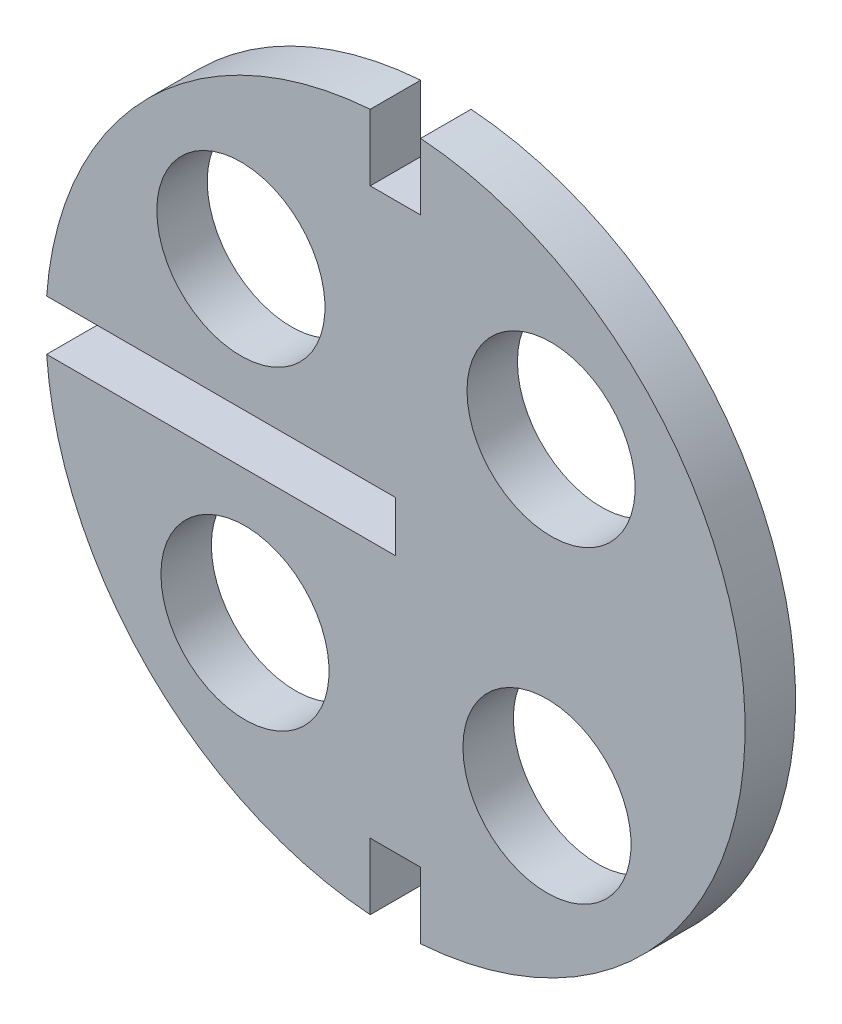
from build123d import *

# Parameters (mm, degrees)
SKETCH1_R          = 26.416
EXTRUDE1_DEPTH     = 3.81
SKETCH2_R          = 6.35
CUT_EXTRUDE1_DEPTH = 38.551647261
SKETCH3_W          = 3.81
SKETCH3_H          = 6.083564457
SKETCH3_H_2        = 6.587446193
SKETCH3_W_2        = 28.301357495
SKETCH3_H_3        = 3.81
CUT_EXTRUDE2_DEPTH = 38.551647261


with BuildPart() as part:
    # Sketch1 → Extrude1 (new body)
    with BuildSketch(Plane.XY):
        with Locations(Location((0, 0, 0), (0, 0, 180))):
            Circle(SKETCH1_R)
    extrude(amount=EXTRUDE1_DEPTH)

    # Sketch2 → Cut-Extrude1 (cut, through all)
    with BuildSketch(Plane.XY):
        with Locations(Location((-11.674332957, 11.674332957, 0), (0, 0, 180))):
            Circle(SKETCH2_R)
        with Locations(Location((11.756888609, 11.591189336, 0), (0, 0, 180))):
            Circle(SKETCH2_R)
        with Locations(Location((11.448903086, -11.895491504, 0), (0, 0, 180))):
            Circle(SKETCH2_R)
        with Locations(Location((-11.364280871, -11.976360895, 0), (0, 0, 180))):
            Circle(SKETCH2_R)
    extrude(amount=CUT_EXTRUDE1_DEPTH, mode=Mode.SUBTRACT)

    # Sketch3 → Cut-Extrude2 (cut, through all)
    with BuildSketch(Plane.XY):
        with Locations((0, 24.377782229)):
            Rectangle(SKETCH3_W, SKETCH3_H)
        with Locations((0, -24.629723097)):
            Rectangle(SKETCH3_W, SKETCH3_H_2)
        with Locations((-14.150678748, 0)):
            Rectangle(SKETCH3_W_2, SKETCH3_H_3)
    extrude(amount=CUT_EXTRUDE2_DEPTH, mode=Mode.SUBTRACT)


solid = part.part
